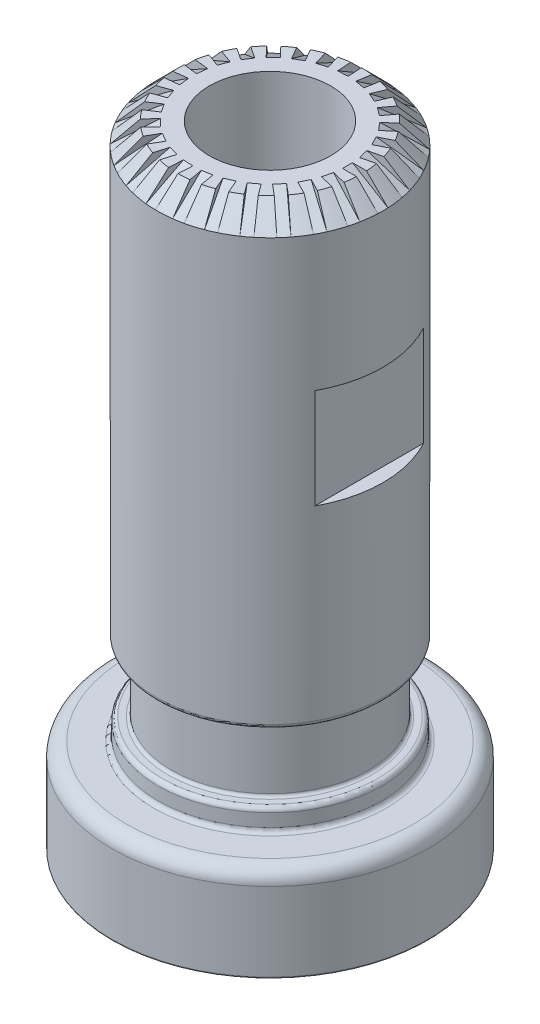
from build123d import *

# Parameters (mm, degrees)
CONG_1_R                     = 1
CONG_2_R                     = 0.2
CONG_3_R                     = 0.3
CONG_4_R                     = 0.1
ENL_V_MAT_EXTRU_1_DEPTH      = 0.35
R_P_TITION_CIRCULAIRE1_COUNT = 27
ESQUISSE4_W                  = 7.891997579
ESQUISSE4_H                  = 7
ESQUISSE4_W_2                = 4.052647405
ENL_V_MAT_EXTRU_2_DEPTH      = 40.35


with BuildPart() as part:
    # Esquisse1 → R_volution1 (revolve)
    with BuildSketch(Plane.XY, mode=Mode.PRIVATE) as r_volution1_sk:
        Polygon((2.75, 21.15), (2.75, 5.2), (4.2, 5.2), (4.2, 3), (8.1, 3), (8.1, 0.5), (9, 0.5), (9.3, 0), (9.7, 0), (10, 0.5), (11.075, 0.5), (11.075, 7.1), (7.85, 7.1), (7.85, 8.6), (6.925, 8.6), (6.925, 13.4), (7.925, 13.4), (7.925, 43.25), (6.425, 44.75), (4.25, 44.75), (4.25, 36.3), (2.75, 36.3), (2.75, 23.25), (1.25, 23.25), (1.25, 21.15), align=None)
    revolve(r_volution1_sk.sketch.rotate(Axis((0, 0, 0), (0, 1, 0)), 90), axis=Axis((0, 0, 0), (0, 1, 0)))

    # Cong_1
    cong_1_edges = [part.edges().sort_by_distance(p)[0] for p in [
        (0, 7.1, 11.075),
    ]]
    fillet(cong_1_edges, radius=CONG_1_R)

    # Cong_2
    cong_2_edges = [part.edges().sort_by_distance(p)[0] for p in [
        (0, 8.6, 6.925),
        (0, 13.4, 6.925),
    ]]
    fillet(cong_2_edges, radius=CONG_2_R)

    # Cong_3
    cong_3_edges = [part.edges().sort_by_distance(p)[0] for p in [
        (0, 7.1, 7.85),
        (0, 8.6, 7.85),
        (0, 13.4, 7.925),
    ]]
    fillet(cong_3_edges, radius=CONG_3_R)

    # Cong_4
    cong_4_edges = [part.edges().sort_by_distance(p)[0] for p in [
        (0, 3, 4.2),
        (0, 3, 8.1),
        (0, 0.5, 8.1),
        (0, 0.5, 9),
        (0, 0, 9.3),
        (0, 0, 9.7),
        (0, 0.5, 10),
        (0, 0.5, 11.075),
    ]]
    fillet(cong_4_edges, radius=CONG_4_R)

    # Esquisse2 → Enl_v. mat.-Extru.1 (cut, symmetric)
    with BuildSketch(Plane.XY):
        Polygon((7.925, 43.25), (4.155459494, 45.516610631), (9.287904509, 45.516610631), (9.958773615, 41.86267211), align=None)
    enl_v_mat_extru_1 = extrude(amount=ENL_V_MAT_EXTRU_1_DEPTH, both=True, mode=Mode.SUBTRACT)

    # R_p_tition circulaire1: Enl_v. mat.-Extru.1 ×27 about axis
    r_p_tition_circulaire1_axis = Axis((0, 0, 0), (0, 1, 0))
    for i in range(1, R_P_TITION_CIRCULAIRE1_COUNT):
        add(enl_v_mat_extru_1.rotate(r_p_tition_circulaire1_axis, i * 360 / R_P_TITION_CIRCULAIRE1_COUNT), mode=Mode.SUBTRACT)

    # Esquisse4 → Enl_v. mat.-Extru.2 (cut, symmetric)
    with BuildSketch(Plane.XY):
        with Locations((-10.89599879, 30.25)):
            Rectangle(ESQUISSE4_W, ESQUISSE4_H)
        with Locations((8.976323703, 30.25)):
            Rectangle(ESQUISSE4_W_2, ESQUISSE4_H)
    extrude(amount=ENL_V_MAT_EXTRU_2_DEPTH, both=True, mode=Mode.SUBTRACT)


solid = part.part
